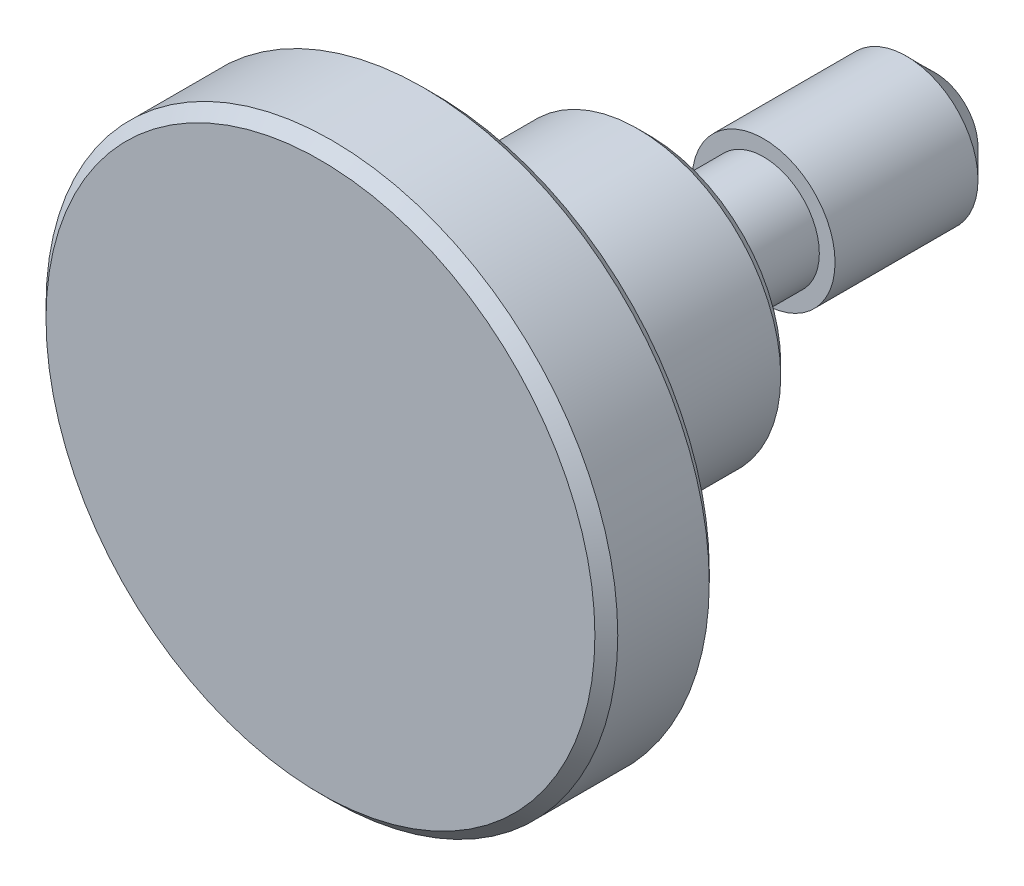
ISO-10303-21;
HEADER;
FILE_DESCRIPTION(('STEP AP214'),'2;1');
FILE_NAME('part.step','',(''),(''),'','','');
FILE_SCHEMA(('AUTOMOTIVE_DESIGN { 1 0 10303 214 1 1 1 1 }'));
ENDSEC;
DATA;
#1=APPLICATION_CONTEXT('core data for automotive mechanical design processes');
#2=APPLICATION_PROTOCOL_DEFINITION('international standard','automotive_design',2000,#1);
#3=PRODUCT_CONTEXT('',#1,'mechanical');
#4=PRODUCT('Part','Part','',(#3));
#5=PRODUCT_RELATED_PRODUCT_CATEGORY('part','',(#4));
#6=PRODUCT_DEFINITION_FORMATION('','',#4);
#7=PRODUCT_DEFINITION_CONTEXT('part definition',#1,'design');
#8=PRODUCT_DEFINITION('design','',#6,#7);
#9=PRODUCT_DEFINITION_SHAPE('','',#8);
#10=(LENGTH_UNIT() NAMED_UNIT(*) SI_UNIT(.MILLI.,.METRE.));
#11=(NAMED_UNIT(*) PLANE_ANGLE_UNIT() SI_UNIT($,.RADIAN.));
#12=(NAMED_UNIT(*) SI_UNIT($,.STERADIAN.) SOLID_ANGLE_UNIT());
#13=UNCERTAINTY_MEASURE_WITH_UNIT(LENGTH_MEASURE(1.E-05),#10,'distance_accuracy_value','');
#14=(GEOMETRIC_REPRESENTATION_CONTEXT(3) GLOBAL_UNCERTAINTY_ASSIGNED_CONTEXT((#13)) GLOBAL_UNIT_ASSIGNED_CONTEXT((#10,
#11,#12)) REPRESENTATION_CONTEXT('',''));
#15=CARTESIAN_POINT('',(0.,0.,0.));
#16=DIRECTION('',(0.,0.,1.));
#17=DIRECTION('',(1.,0.,0.));
#18=AXIS2_PLACEMENT_3D('',#15,#16,#17);
#19=CARTESIAN_POINT('',(0.,0.,6.5));
#20=DIRECTION('',(0.,0.,1.));
#21=DIRECTION('',(1.,0.,0.));
#22=AXIS2_PLACEMENT_3D('',#19,#20,#21);
#23=TOROIDAL_SURFACE('',#22,6.,1.);
#24=CARTESIAN_POINT('',(0.,0.,6.5));
#25=DIRECTION('',(0.,0.,1.));
#26=DIRECTION('',(1.,0.,0.));
#27=AXIS2_PLACEMENT_3D('',#24,#25,#26);
#28=CIRCLE('',#27,5.);
#29=CARTESIAN_POINT('',(5.,0.,6.5));
#30=VERTEX_POINT('',#29);
#31=EDGE_CURVE('E8',#30,#30,#28,.T.);
#32=ORIENTED_EDGE('',*,*,#31,.T.);
#33=EDGE_LOOP('',(#32));
#34=FACE_BOUND('',#33,.T.);
#35=CARTESIAN_POINT('',(0.,0.,7.5));
#36=DIRECTION('',(0.,0.,1.));
#37=DIRECTION('',(1.,0.,0.));
#38=AXIS2_PLACEMENT_3D('',#35,#36,#37);
#39=CIRCLE('',#38,6.);
#40=CARTESIAN_POINT('',(6.,0.,7.5));
#41=VERTEX_POINT('',#40);
#42=EDGE_CURVE('E58',#41,#41,#39,.T.);
#43=ORIENTED_EDGE('',*,*,#42,.F.);
#44=EDGE_LOOP('',(#43));
#45=FACE_BOUND('',#44,.T.);
#46=ADVANCED_FACE('F12',(#34,#45),#23,.F.);
#47=CARTESIAN_POINT('',(0.,0.,11.5));
#48=DIRECTION('',(0.,0.,1.));
#49=DIRECTION('',(1.,0.,0.));
#50=AXIS2_PLACEMENT_3D('',#47,#48,#49);
#51=CYLINDRICAL_SURFACE('',#50,5.);
#52=CARTESIAN_POINT('',(0.,0.,0.400000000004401));
#53=DIRECTION('',(0.,0.,1.));
#54=DIRECTION('',(1.,0.,0.));
#55=AXIS2_PLACEMENT_3D('',#52,#53,#54);
#56=CIRCLE('',#55,5.);
#57=CARTESIAN_POINT('',(5.,0.,0.400000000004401));
#58=VERTEX_POINT('',#57);
#59=EDGE_CURVE('E18',#58,#58,#56,.T.);
#60=ORIENTED_EDGE('',*,*,#59,.T.);
#61=EDGE_LOOP('',(#60));
#62=FACE_BOUND('',#61,.T.);
#63=ORIENTED_EDGE('',*,*,#31,.F.);
#64=EDGE_LOOP('',(#63));
#65=FACE_BOUND('',#64,.T.);
#66=ADVANCED_FACE('F66',(#62,#65),#51,.T.);
#67=CARTESIAN_POINT('',(0.,0.,0.400000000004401));
#68=DIRECTION('',(0.,0.,1.));
#69=DIRECTION('',(1.,0.,0.));
#70=AXIS2_PLACEMENT_3D('',#67,#68,#69);
#71=CONICAL_SURFACE('',#70,5.,0.785398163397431);
#72=CARTESIAN_POINT('',(0.,0.,0.));
#73=DIRECTION('',(0.,0.,1.));
#74=DIRECTION('',(1.,0.,0.));
#75=AXIS2_PLACEMENT_3D('',#72,#73,#74);
#76=CIRCLE('',#75,4.59999999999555);
#77=CARTESIAN_POINT('',(4.59999999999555,0.,0.));
#78=VERTEX_POINT('',#77);
#79=EDGE_CURVE('E22',#78,#78,#76,.T.);
#80=ORIENTED_EDGE('',*,*,#79,.T.);
#81=EDGE_LOOP('',(#80));
#82=FACE_BOUND('',#81,.T.);
#83=ORIENTED_EDGE('',*,*,#59,.F.);
#84=EDGE_LOOP('',(#83));
#85=FACE_BOUND('',#84,.T.);
#86=ADVANCED_FACE('F72',(#82,#85),#71,.T.);
#87=CARTESIAN_POINT('',(0.,-4.59999999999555,0.));
#88=DIRECTION('',(0.,0.,-1.));
#89=DIRECTION('',(-1.,0.,0.));
#90=AXIS2_PLACEMENT_3D('',#87,#88,#89);
#91=PLANE('',#90);
#92=CARTESIAN_POINT('',(0.,0.,0.));
#93=DIRECTION('',(0.,0.,1.));
#94=DIRECTION('',(1.,0.,0.));
#95=AXIS2_PLACEMENT_3D('',#92,#93,#94);
#96=CIRCLE('',#95,2.35);
#97=CARTESIAN_POINT('',(2.35,0.,0.));
#98=VERTEX_POINT('',#97);
#99=EDGE_CURVE('E26',#98,#98,#96,.T.);
#100=ORIENTED_EDGE('',*,*,#99,.T.);
#101=EDGE_LOOP('',(#100));
#102=FACE_BOUND('',#101,.T.);
#103=ORIENTED_EDGE('',*,*,#79,.F.);
#104=EDGE_LOOP('',(#103));
#105=FACE_BOUND('',#104,.T.);
#106=ADVANCED_FACE('F77',(#102,#105),#91,.T.);
#107=CARTESIAN_POINT('',(0.,0.,-0.4));
#108=DIRECTION('',(0.,0.,1.));
#109=DIRECTION('',(1.,0.,0.));
#110=AXIS2_PLACEMENT_3D('',#107,#108,#109);
#111=TOROIDAL_SURFACE('',#110,2.35,0.4);
#112=CARTESIAN_POINT('',(0.,0.,-0.4));
#113=DIRECTION('',(0.,0.,1.));
#114=DIRECTION('',(1.,0.,0.));
#115=AXIS2_PLACEMENT_3D('',#112,#113,#114);
#116=CIRCLE('',#115,1.95);
#117=CARTESIAN_POINT('',(1.95,0.,-0.4));
#118=VERTEX_POINT('',#117);
#119=EDGE_CURVE('E31',#118,#118,#116,.T.);
#120=ORIENTED_EDGE('',*,*,#119,.T.);
#121=EDGE_LOOP('',(#120));
#122=FACE_BOUND('',#121,.T.);
#123=ORIENTED_EDGE('',*,*,#99,.F.);
#124=EDGE_LOOP('',(#123));
#125=FACE_BOUND('',#124,.T.);
#126=ADVANCED_FACE('F84',(#122,#125),#111,.F.);
#127=CARTESIAN_POINT('',(0.,0.,11.5));
#128=DIRECTION('',(0.,0.,1.));
#129=DIRECTION('',(1.,0.,0.));
#130=AXIS2_PLACEMENT_3D('',#127,#128,#129);
#131=CYLINDRICAL_SURFACE('',#130,1.95);
#132=CARTESIAN_POINT('',(0.,0.,-4.));
#133=DIRECTION('',(0.,0.,1.));
#134=DIRECTION('',(1.,0.,0.));
#135=AXIS2_PLACEMENT_3D('',#132,#133,#134);
#136=CIRCLE('',#135,1.95);
#137=CARTESIAN_POINT('',(1.95,0.,-4.));
#138=VERTEX_POINT('',#137);
#139=EDGE_CURVE('E34',#138,#138,#136,.T.);
#140=ORIENTED_EDGE('',*,*,#139,.T.);
#141=EDGE_LOOP('',(#140));
#142=FACE_BOUND('',#141,.T.);
#143=ORIENTED_EDGE('',*,*,#119,.F.);
#144=EDGE_LOOP('',(#143));
#145=FACE_BOUND('',#144,.T.);
#146=ADVANCED_FACE('F88',(#142,#145),#131,.T.);
#147=CARTESIAN_POINT('',(0.,-1.95,-4.));
#148=DIRECTION('',(0.,0.,1.));
#149=DIRECTION('',(1.,0.,0.));
#150=AXIS2_PLACEMENT_3D('',#147,#148,#149);
#151=PLANE('',#150);
#152=CARTESIAN_POINT('',(0.,0.,-4.));
#153=DIRECTION('',(0.,0.,1.));
#154=DIRECTION('',(1.,0.,0.));
#155=AXIS2_PLACEMENT_3D('',#152,#153,#154);
#156=CIRCLE('',#155,2.49999999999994);
#157=CARTESIAN_POINT('',(2.49999999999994,0.,-4.));
#158=VERTEX_POINT('',#157);
#159=EDGE_CURVE('E37',#158,#158,#156,.T.);
#160=ORIENTED_EDGE('',*,*,#159,.T.);
#161=EDGE_LOOP('',(#160));
#162=FACE_BOUND('',#161,.T.);
#163=ORIENTED_EDGE('',*,*,#139,.F.);
#164=EDGE_LOOP('',(#163));
#165=FACE_BOUND('',#164,.T.);
#166=ADVANCED_FACE('F92',(#162,#165),#151,.T.);
#167=CARTESIAN_POINT('',(0.,0.,11.5));
#168=DIRECTION('',(0.,0.,1.));
#169=DIRECTION('',(1.,0.,0.));
#170=AXIS2_PLACEMENT_3D('',#167,#168,#169);
#171=CYLINDRICAL_SURFACE('',#170,2.49999999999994);
#172=CARTESIAN_POINT('',(0.,0.,-9.));
#173=DIRECTION('',(0.,0.,1.));
#174=DIRECTION('',(1.,0.,0.));
#175=AXIS2_PLACEMENT_3D('',#172,#173,#174);
#176=CIRCLE('',#175,2.49999999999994);
#177=CARTESIAN_POINT('',(2.49999999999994,0.,-9.));
#178=VERTEX_POINT('',#177);
#179=EDGE_CURVE('E40',#178,#178,#176,.T.);
#180=ORIENTED_EDGE('',*,*,#179,.T.);
#181=EDGE_LOOP('',(#180));
#182=FACE_BOUND('',#181,.T.);
#183=ORIENTED_EDGE('',*,*,#159,.F.);
#184=EDGE_LOOP('',(#183));
#185=FACE_BOUND('',#184,.T.);
#186=ADVANCED_FACE('F96',(#182,#185),#171,.T.);
#187=CARTESIAN_POINT('',(0.,0.,-9.));
#188=DIRECTION('',(0.,0.,1.));
#189=DIRECTION('',(1.,0.,0.));
#190=AXIS2_PLACEMENT_3D('',#187,#188,#189);
#191=CONICAL_SURFACE('',#190,2.49999999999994,0.785398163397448);
#192=CARTESIAN_POINT('',(0.,0.,-10.));
#193=DIRECTION('',(0.,0.,1.));
#194=DIRECTION('',(1.,0.,0.));
#195=AXIS2_PLACEMENT_3D('',#192,#193,#194);
#196=CIRCLE('',#195,1.49999999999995);
#197=CARTESIAN_POINT('',(1.49999999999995,0.,-10.));
#198=VERTEX_POINT('',#197);
#199=EDGE_CURVE('E43',#198,#198,#196,.T.);
#200=ORIENTED_EDGE('',*,*,#199,.T.);
#201=EDGE_LOOP('',(#200));
#202=FACE_BOUND('',#201,.T.);
#203=ORIENTED_EDGE('',*,*,#179,.F.);
#204=EDGE_LOOP('',(#203));
#205=FACE_BOUND('',#204,.T.);
#206=ADVANCED_FACE('F100',(#202,#205),#191,.T.);
#207=CARTESIAN_POINT('',(0.,0.,-10.));
#208=DIRECTION('',(0.,0.,-1.));
#209=DIRECTION('',(-1.,0.,0.));
#210=AXIS2_PLACEMENT_3D('',#207,#208,#209);
#211=PLANE('',#210);
#212=ORIENTED_EDGE('',*,*,#199,.F.);
#213=EDGE_LOOP('',(#212));
#214=FACE_BOUND('',#213,.T.);
#215=ADVANCED_FACE('F104',(#214),#211,.T.);
#216=CARTESIAN_POINT('',(0.,0.,11.5));
#217=DIRECTION('',(0.,0.,1.));
#218=DIRECTION('',(1.,0.,0.));
#219=AXIS2_PLACEMENT_3D('',#216,#217,#218);
#220=PLANE('',#219);
#221=CARTESIAN_POINT('',(0.,0.,11.5));
#222=DIRECTION('',(0.,0.,1.));
#223=DIRECTION('',(1.,0.,0.));
#224=AXIS2_PLACEMENT_3D('',#221,#222,#223);
#225=CIRCLE('',#224,9.6);
#226=CARTESIAN_POINT('',(9.6,0.,11.5));
#227=VERTEX_POINT('',#226);
#228=EDGE_CURVE('E46',#227,#227,#225,.T.);
#229=ORIENTED_EDGE('',*,*,#228,.T.);
#230=EDGE_LOOP('',(#229));
#231=FACE_BOUND('',#230,.T.);
#232=ADVANCED_FACE('F108',(#231),#220,.T.);
#233=CARTESIAN_POINT('',(0.,0.,11.5));
#234=DIRECTION('',(0.,0.,-1.));
#235=DIRECTION('',(-1.,0.,0.));
#236=AXIS2_PLACEMENT_3D('',#233,#234,#235);
#237=CONICAL_SURFACE('',#236,9.6,0.785398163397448);
#238=CARTESIAN_POINT('',(0.,0.,11.1000000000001));
#239=DIRECTION('',(0.,0.,1.));
#240=DIRECTION('',(1.,0.,0.));
#241=AXIS2_PLACEMENT_3D('',#238,#239,#240);
#242=CIRCLE('',#241,10.);
#243=CARTESIAN_POINT('',(10.,0.,11.1000000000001));
#244=VERTEX_POINT('',#243);
#245=EDGE_CURVE('E49',#244,#244,#242,.T.);
#246=ORIENTED_EDGE('',*,*,#245,.T.);
#247=EDGE_LOOP('',(#246));
#248=FACE_BOUND('',#247,.T.);
#249=ORIENTED_EDGE('',*,*,#228,.F.);
#250=EDGE_LOOP('',(#249));
#251=FACE_BOUND('',#250,.T.);
#252=ADVANCED_FACE('F112',(#248,#251),#237,.T.);
#253=CARTESIAN_POINT('',(0.,0.,11.5));
#254=DIRECTION('',(0.,0.,1.));
#255=DIRECTION('',(1.,0.,0.));
#256=AXIS2_PLACEMENT_3D('',#253,#254,#255);
#257=CYLINDRICAL_SURFACE('',#256,10.);
#258=CARTESIAN_POINT('',(0.,0.,7.90000000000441));
#259=DIRECTION('',(0.,0.,1.));
#260=DIRECTION('',(1.,0.,0.));
#261=AXIS2_PLACEMENT_3D('',#258,#259,#260);
#262=CIRCLE('',#261,10.);
#263=CARTESIAN_POINT('',(10.,0.,7.90000000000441));
#264=VERTEX_POINT('',#263);
#265=EDGE_CURVE('E52',#264,#264,#262,.T.);
#266=ORIENTED_EDGE('',*,*,#265,.T.);
#267=EDGE_LOOP('',(#266));
#268=FACE_BOUND('',#267,.T.);
#269=ORIENTED_EDGE('',*,*,#245,.F.);
#270=EDGE_LOOP('',(#269));
#271=FACE_BOUND('',#270,.T.);
#272=ADVANCED_FACE('F116',(#268,#271),#257,.T.);
#273=CARTESIAN_POINT('',(0.,0.,7.90000000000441));
#274=DIRECTION('',(0.,0.,1.));
#275=DIRECTION('',(1.,0.,0.));
#276=AXIS2_PLACEMENT_3D('',#273,#274,#275);
#277=CONICAL_SURFACE('',#276,10.,0.785398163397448);
#278=CARTESIAN_POINT('',(0.,0.,7.5));
#279=DIRECTION('',(0.,0.,1.));
#280=DIRECTION('',(1.,0.,0.));
#281=AXIS2_PLACEMENT_3D('',#278,#279,#280);
#282=CIRCLE('',#281,9.59999999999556);
#283=CARTESIAN_POINT('',(9.59999999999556,0.,7.5));
#284=VERTEX_POINT('',#283);
#285=EDGE_CURVE('E55',#284,#284,#282,.T.);
#286=ORIENTED_EDGE('',*,*,#285,.T.);
#287=EDGE_LOOP('',(#286));
#288=FACE_BOUND('',#287,.T.);
#289=ORIENTED_EDGE('',*,*,#265,.F.);
#290=EDGE_LOOP('',(#289));
#291=FACE_BOUND('',#290,.T.);
#292=ADVANCED_FACE('F120',(#288,#291),#277,.T.);
#293=CARTESIAN_POINT('',(0.,-9.59999999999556,7.5));
#294=DIRECTION('',(0.,0.,-1.));
#295=DIRECTION('',(-1.,0.,0.));
#296=AXIS2_PLACEMENT_3D('',#293,#294,#295);
#297=PLANE('',#296);
#298=ORIENTED_EDGE('',*,*,#42,.T.);
#299=EDGE_LOOP('',(#298));
#300=FACE_BOUND('',#299,.T.);
#301=ORIENTED_EDGE('',*,*,#285,.F.);
#302=EDGE_LOOP('',(#301));
#303=FACE_BOUND('',#302,.T.);
#304=ADVANCED_FACE('F62',(#300,#303),#297,.T.);
#305=CLOSED_SHELL('',(#46,#66,#86,#106,#126,#146,#166,#186,#206,#215,#232,#252,#272,#292,#304));
#306=MANIFOLD_SOLID_BREP('B1',#305);
#307=ADVANCED_BREP_SHAPE_REPRESENTATION('',(#18,#306),#14);
#308=SHAPE_DEFINITION_REPRESENTATION(#9,#307);
ENDSEC;
END-ISO-10303-21;
